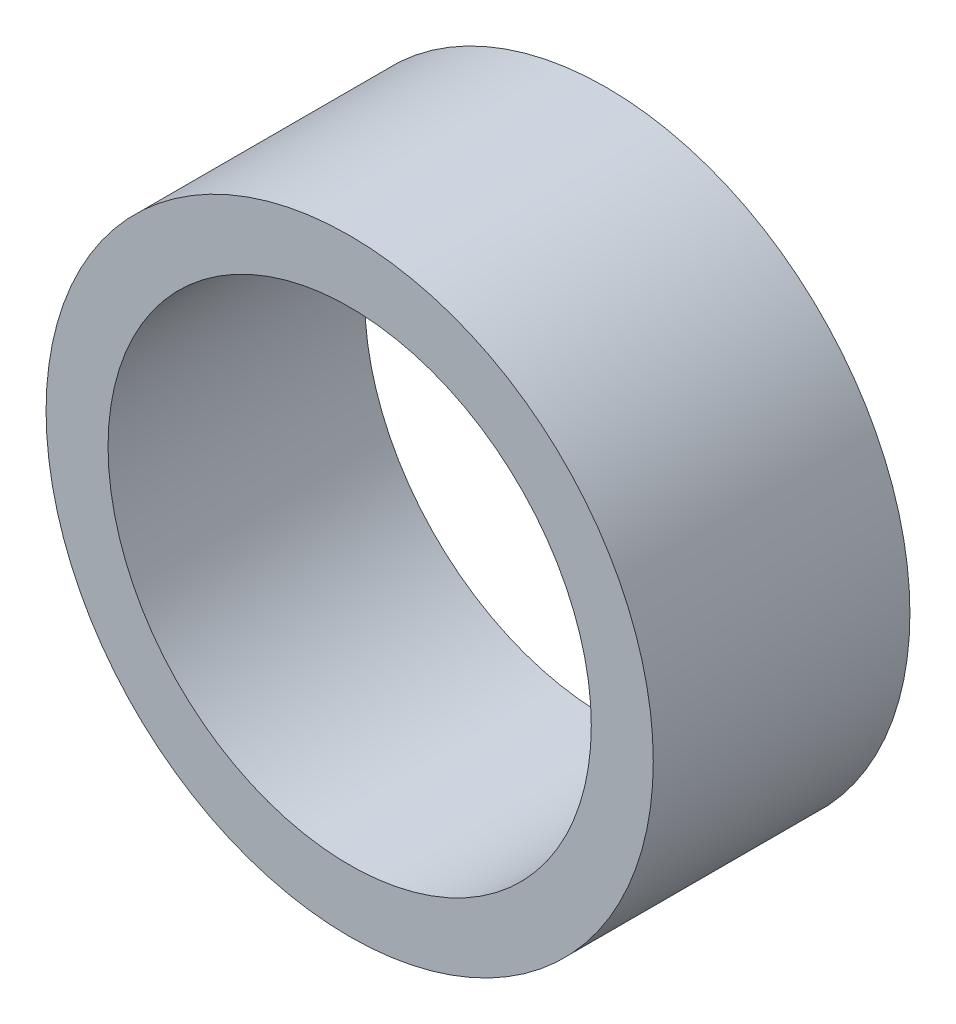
from build123d import *

# Parameters (mm, degrees)
SKETCH1_R          = 6.1595
EXTRUDE1_DEPTH     = 5.207
SKETCH5_R          = 4.9022
CUT_EXTRUDE3_DEPTH = 11.897266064


with BuildPart() as part:
    # Sketch1 → Extrude1 (new body)
    with BuildSketch(Plane.XY):
        with Locations((1.1684, 0)):
            Circle(SKETCH1_R)
    extrude(amount=EXTRUDE1_DEPTH)

    # Sketch5 → Cut-Extrude3 (cut, through all)
    with BuildSketch(Plane(origin=(0, 0, 0), x_dir=(-1, 0, 0), z_dir=(0, 0, -1))):
        with Locations((-1.1684, 0)):
            Circle(SKETCH5_R)
    extrude(amount=-CUT_EXTRUDE3_DEPTH, mode=Mode.SUBTRACT)


solid = part.part
